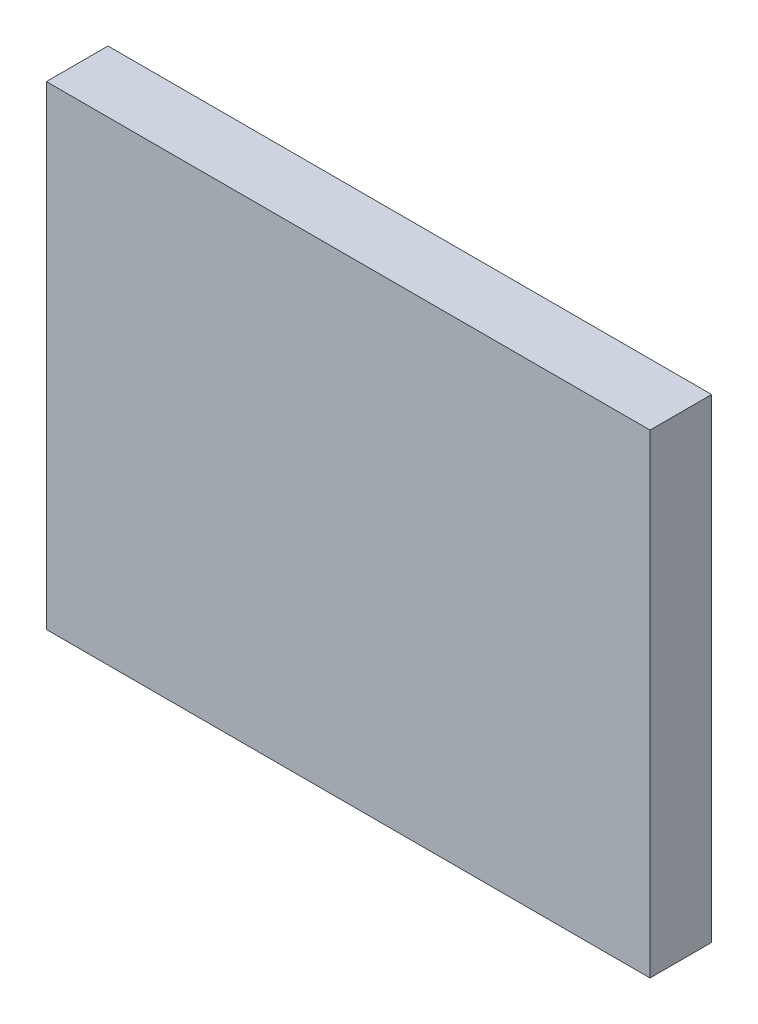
ISO-10303-21;
HEADER;
FILE_DESCRIPTION(('STEP AP214'),'2;1');
FILE_NAME('part.step','',(''),(''),'','','');
FILE_SCHEMA(('AUTOMOTIVE_DESIGN { 1 0 10303 214 1 1 1 1 }'));
ENDSEC;
DATA;
#1=APPLICATION_CONTEXT('core data for automotive mechanical design processes');
#2=APPLICATION_PROTOCOL_DEFINITION('international standard','automotive_design',2000,#1);
#3=PRODUCT_CONTEXT('',#1,'mechanical');
#4=PRODUCT('Part','Part','',(#3));
#5=PRODUCT_RELATED_PRODUCT_CATEGORY('part','',(#4));
#6=PRODUCT_DEFINITION_FORMATION('','',#4);
#7=PRODUCT_DEFINITION_CONTEXT('part definition',#1,'design');
#8=PRODUCT_DEFINITION('design','',#6,#7);
#9=PRODUCT_DEFINITION_SHAPE('','',#8);
#10=(LENGTH_UNIT() NAMED_UNIT(*) SI_UNIT(.MILLI.,.METRE.));
#11=(NAMED_UNIT(*) PLANE_ANGLE_UNIT() SI_UNIT($,.RADIAN.));
#12=(NAMED_UNIT(*) SI_UNIT($,.STERADIAN.) SOLID_ANGLE_UNIT());
#13=UNCERTAINTY_MEASURE_WITH_UNIT(LENGTH_MEASURE(1.E-05),#10,'distance_accuracy_value','');
#14=(GEOMETRIC_REPRESENTATION_CONTEXT(3) GLOBAL_UNCERTAINTY_ASSIGNED_CONTEXT((#13)) GLOBAL_UNIT_ASSIGNED_CONTEXT((#10,
#11,#12)) REPRESENTATION_CONTEXT('',''));
#15=CARTESIAN_POINT('',(0.,0.,0.));
#16=DIRECTION('',(0.,0.,1.));
#17=DIRECTION('',(1.,0.,0.));
#18=AXIS2_PLACEMENT_3D('',#15,#16,#17);
#19=CARTESIAN_POINT('',(0.,0.,0.));
#20=DIRECTION('',(0.,0.,1.));
#21=DIRECTION('',(1.,0.,0.));
#22=AXIS2_PLACEMENT_3D('',#19,#20,#21);
#23=PLANE('',#22);
#24=DIRECTION('',(0.,-1.,0.));
#25=VECTOR('',#24,1.);
#26=CARTESIAN_POINT('',(52.5830200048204,0.,0.));
#27=LINE('',#26,#25);
#28=CARTESIAN_POINT('',(52.5830200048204,32.4481286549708,0.));
#29=VERTEX_POINT('',#28);
#30=CARTESIAN_POINT('',(52.5830200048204,-44.5688304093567,0.));
#31=VERTEX_POINT('',#30);
#32=EDGE_CURVE('E129',#29,#31,#27,.T.);
#33=ORIENTED_EDGE('',*,*,#32,.T.);
#34=DIRECTION('',(1.,0.,0.));
#35=VECTOR('',#34,1.);
#36=CARTESIAN_POINT('',(0.,-44.5688304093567,0.));
#37=LINE('',#36,#35);
#38=CARTESIAN_POINT('',(-45.3926525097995,-44.5688304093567,0.));
#39=VERTEX_POINT('',#38);
#40=EDGE_CURVE('E124',#39,#31,#37,.T.);
#41=ORIENTED_EDGE('',*,*,#40,.F.);
#42=DIRECTION('',(0.,-1.,0.));
#43=VECTOR('',#42,1.);
#44=CARTESIAN_POINT('',(-45.3926525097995,0.,0.));
#45=LINE('',#44,#43);
#46=CARTESIAN_POINT('',(-45.3926525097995,32.4481286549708,0.));
#47=VERTEX_POINT('',#46);
#48=EDGE_CURVE('E100',#47,#39,#45,.T.);
#49=ORIENTED_EDGE('',*,*,#48,.F.);
#50=DIRECTION('',(1.,0.,0.));
#51=VECTOR('',#50,1.);
#52=CARTESIAN_POINT('',(0.,32.4481286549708,0.));
#53=LINE('',#52,#51);
#54=EDGE_CURVE('E120',#47,#29,#53,.T.);
#55=ORIENTED_EDGE('',*,*,#54,.T.);
#56=EDGE_LOOP('',(#33,#41,#49,#55));
#57=FACE_BOUND('',#56,.T.);
#58=ADVANCED_FACE('F62',(#57),#23,.F.);
#59=CARTESIAN_POINT('',(-45.3926525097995,0.,10.));
#60=DIRECTION('',(1.,0.,0.));
#61=DIRECTION('',(0.,0.,-1.));
#62=AXIS2_PLACEMENT_3D('',#59,#60,#61);
#63=PLANE('',#62);
#64=ORIENTED_EDGE('',*,*,#48,.T.);
#65=DIRECTION('',(0.,0.,-1.));
#66=VECTOR('',#65,1.);
#67=CARTESIAN_POINT('',(-45.3926525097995,-44.5688304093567,10.));
#68=LINE('',#67,#66);
#69=CARTESIAN_POINT('',(-45.3926525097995,-44.5688304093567,10.));
#70=VERTEX_POINT('',#69);
#71=EDGE_CURVE('E116',#70,#39,#68,.T.);
#72=ORIENTED_EDGE('',*,*,#71,.F.);
#73=DIRECTION('',(0.,-1.,0.));
#74=VECTOR('',#73,1.);
#75=CARTESIAN_POINT('',(-45.3926525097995,0.,10.));
#76=LINE('',#75,#74);
#77=CARTESIAN_POINT('',(-45.3926525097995,32.4481286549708,10.));
#78=VERTEX_POINT('',#77);
#79=EDGE_CURVE('E119',#78,#70,#76,.T.);
#80=ORIENTED_EDGE('',*,*,#79,.F.);
#81=DIRECTION('',(0.,0.,-1.));
#82=VECTOR('',#81,1.);
#83=CARTESIAN_POINT('',(-45.3926525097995,32.4481286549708,10.));
#84=LINE('',#83,#82);
#85=EDGE_CURVE('E74',#78,#47,#84,.T.);
#86=ORIENTED_EDGE('',*,*,#85,.T.);
#87=EDGE_LOOP('',(#64,#72,#80,#86));
#88=FACE_BOUND('',#87,.T.);
#89=ADVANCED_FACE('F117',(#88),#63,.F.);
#90=CARTESIAN_POINT('',(0.,32.4481286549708,10.));
#91=DIRECTION('',(0.,1.,0.));
#92=DIRECTION('',(0.,0.,1.));
#93=AXIS2_PLACEMENT_3D('',#90,#91,#92);
#94=PLANE('',#93);
#95=ORIENTED_EDGE('',*,*,#54,.F.);
#96=ORIENTED_EDGE('',*,*,#85,.F.);
#97=DIRECTION('',(1.,0.,0.));
#98=VECTOR('',#97,1.);
#99=CARTESIAN_POINT('',(0.,32.4481286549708,10.));
#100=LINE('',#99,#98);
#101=CARTESIAN_POINT('',(52.5830200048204,32.4481286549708,10.));
#102=VERTEX_POINT('',#101);
#103=EDGE_CURVE('E113',#78,#102,#100,.T.);
#104=ORIENTED_EDGE('',*,*,#103,.T.);
#105=DIRECTION('',(0.,0.,-1.));
#106=VECTOR('',#105,1.);
#107=CARTESIAN_POINT('',(52.5830200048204,32.4481286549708,10.));
#108=LINE('',#107,#106);
#109=EDGE_CURVE('E12',#102,#29,#108,.T.);
#110=ORIENTED_EDGE('',*,*,#109,.T.);
#111=EDGE_LOOP('',(#95,#96,#104,#110));
#112=FACE_BOUND('',#111,.T.);
#113=ADVANCED_FACE('F111',(#112),#94,.T.);
#114=CARTESIAN_POINT('',(52.5830200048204,0.,10.));
#115=DIRECTION('',(1.,0.,0.));
#116=DIRECTION('',(0.,0.,-1.));
#117=AXIS2_PLACEMENT_3D('',#114,#115,#116);
#118=PLANE('',#117);
#119=ORIENTED_EDGE('',*,*,#32,.F.);
#120=ORIENTED_EDGE('',*,*,#109,.F.);
#121=DIRECTION('',(0.,-1.,0.));
#122=VECTOR('',#121,1.);
#123=CARTESIAN_POINT('',(52.5830200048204,0.,10.));
#124=LINE('',#123,#122);
#125=CARTESIAN_POINT('',(52.5830200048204,-44.5688304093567,10.));
#126=VERTEX_POINT('',#125);
#127=EDGE_CURVE('E121',#102,#126,#124,.T.);
#128=ORIENTED_EDGE('',*,*,#127,.T.);
#129=DIRECTION('',(0.,0.,-1.));
#130=VECTOR('',#129,1.);
#131=CARTESIAN_POINT('',(52.5830200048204,-44.5688304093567,10.));
#132=LINE('',#131,#130);
#133=EDGE_CURVE('E101',#126,#31,#132,.T.);
#134=ORIENTED_EDGE('',*,*,#133,.T.);
#135=EDGE_LOOP('',(#119,#120,#128,#134));
#136=FACE_BOUND('',#135,.T.);
#137=ADVANCED_FACE('F70',(#136),#118,.T.);
#138=CARTESIAN_POINT('',(0.,-44.5688304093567,10.));
#139=DIRECTION('',(0.,1.,0.));
#140=DIRECTION('',(0.,0.,1.));
#141=AXIS2_PLACEMENT_3D('',#138,#139,#140);
#142=PLANE('',#141);
#143=ORIENTED_EDGE('',*,*,#40,.T.);
#144=ORIENTED_EDGE('',*,*,#133,.F.);
#145=DIRECTION('',(1.,0.,0.));
#146=VECTOR('',#145,1.);
#147=CARTESIAN_POINT('',(0.,-44.5688304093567,10.));
#148=LINE('',#147,#146);
#149=EDGE_CURVE('E85',#70,#126,#148,.T.);
#150=ORIENTED_EDGE('',*,*,#149,.F.);
#151=ORIENTED_EDGE('',*,*,#71,.T.);
#152=EDGE_LOOP('',(#143,#144,#150,#151));
#153=FACE_BOUND('',#152,.T.);
#154=ADVANCED_FACE('F138',(#153),#142,.F.);
#155=CARTESIAN_POINT('',(0.,0.,10.));
#156=DIRECTION('',(0.,0.,1.));
#157=DIRECTION('',(1.,0.,0.));
#158=AXIS2_PLACEMENT_3D('',#155,#156,#157);
#159=PLANE('',#158);
#160=ORIENTED_EDGE('',*,*,#127,.F.);
#161=ORIENTED_EDGE('',*,*,#103,.F.);
#162=ORIENTED_EDGE('',*,*,#79,.T.);
#163=ORIENTED_EDGE('',*,*,#149,.T.);
#164=EDGE_LOOP('',(#160,#161,#162,#163));
#165=FACE_BOUND('',#164,.T.);
#166=ADVANCED_FACE('F122',(#165),#159,.T.);
#167=CLOSED_SHELL('',(#58,#89,#113,#137,#154,#166));
#168=MANIFOLD_SOLID_BREP('B2',#167);
#169=ADVANCED_BREP_SHAPE_REPRESENTATION('',(#18,#168),#14);
#170=SHAPE_DEFINITION_REPRESENTATION(#9,#169);
ENDSEC;
END-ISO-10303-21;
